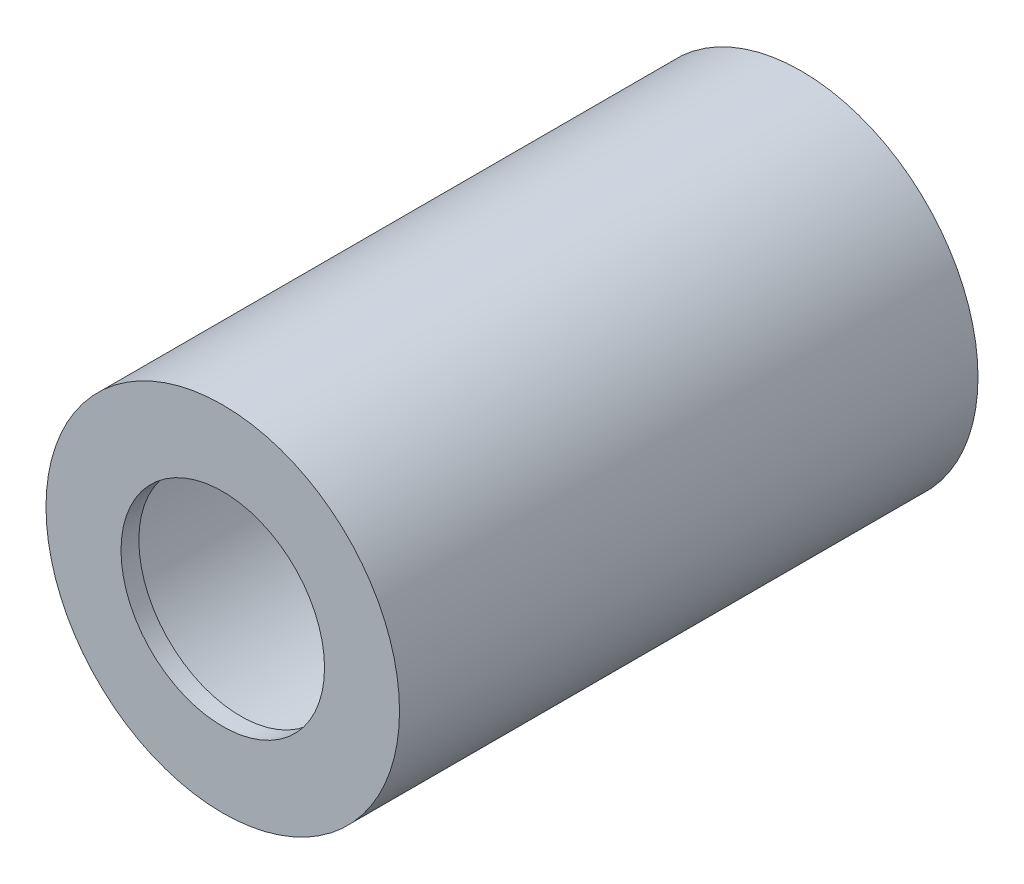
ISO-10303-21;
HEADER;
FILE_DESCRIPTION(('STEP AP214'),'2;1');
FILE_NAME('part.step','',(''),(''),'','','');
FILE_SCHEMA(('AUTOMOTIVE_DESIGN { 1 0 10303 214 1 1 1 1 }'));
ENDSEC;
DATA;
#1=APPLICATION_CONTEXT('core data for automotive mechanical design processes');
#2=APPLICATION_PROTOCOL_DEFINITION('international standard','automotive_design',2000,#1);
#3=PRODUCT_CONTEXT('',#1,'mechanical');
#4=PRODUCT('Part','Part','',(#3));
#5=PRODUCT_RELATED_PRODUCT_CATEGORY('part','',(#4));
#6=PRODUCT_DEFINITION_FORMATION('','',#4);
#7=PRODUCT_DEFINITION_CONTEXT('part definition',#1,'design');
#8=PRODUCT_DEFINITION('design','',#6,#7);
#9=PRODUCT_DEFINITION_SHAPE('','',#8);
#10=(LENGTH_UNIT() NAMED_UNIT(*) SI_UNIT(.MILLI.,.METRE.));
#11=(NAMED_UNIT(*) PLANE_ANGLE_UNIT() SI_UNIT($,.RADIAN.));
#12=(NAMED_UNIT(*) SI_UNIT($,.STERADIAN.) SOLID_ANGLE_UNIT());
#13=UNCERTAINTY_MEASURE_WITH_UNIT(LENGTH_MEASURE(1.E-05),#10,'distance_accuracy_value','');
#14=(GEOMETRIC_REPRESENTATION_CONTEXT(3) GLOBAL_UNCERTAINTY_ASSIGNED_CONTEXT((#13)) GLOBAL_UNIT_ASSIGNED_CONTEXT((#10,
#11,#12)) REPRESENTATION_CONTEXT('',''));
#15=CARTESIAN_POINT('',(0.,0.,0.));
#16=DIRECTION('',(0.,0.,1.));
#17=DIRECTION('',(1.,0.,0.));
#18=AXIS2_PLACEMENT_3D('',#15,#16,#17);
#19=CARTESIAN_POINT('',(-12.723876,-12.723876,-41.148));
#20=DIRECTION('',(0.,0.,1.));
#21=DIRECTION('',(1.,0.,0.));
#22=AXIS2_PLACEMENT_3D('',#19,#20,#21);
#23=PLANE('',#22);
#24=CARTESIAN_POINT('',(0.,0.,-41.148));
#25=DIRECTION('',(0.,0.,1.));
#26=DIRECTION('',(1.,0.,0.));
#27=AXIS2_PLACEMENT_3D('',#24,#25,#26);
#28=CIRCLE('',#27,11.049);
#29=CARTESIAN_POINT('',(11.049,0.,-41.148));
#30=VERTEX_POINT('',#29);
#31=EDGE_CURVE('E18',#30,#30,#28,.F.);
#32=ORIENTED_EDGE('',*,*,#31,.F.);
#33=EDGE_LOOP('',(#32));
#34=FACE_BOUND('',#33,.T.);
#35=CARTESIAN_POINT('',(0.,0.,-41.148));
#36=DIRECTION('',(0.,0.,1.));
#37=DIRECTION('',(1.,0.,0.));
#38=AXIS2_PLACEMENT_3D('',#35,#36,#37);
#39=CIRCLE('',#38,12.573);
#40=CARTESIAN_POINT('',(12.573,0.,-41.148));
#41=VERTEX_POINT('',#40);
#42=EDGE_CURVE('E34',#41,#41,#39,.F.);
#43=ORIENTED_EDGE('',*,*,#42,.T.);
#44=EDGE_LOOP('',(#43));
#45=FACE_BOUND('',#44,.T.);
#46=ADVANCED_FACE('F14',(#34,#45),#23,.F.);
#47=CARTESIAN_POINT('',(0.,0.,-41.148));
#48=DIRECTION('',(0.,0.,1.));
#49=DIRECTION('',(1.,0.,0.));
#50=AXIS2_PLACEMENT_3D('',#47,#48,#49);
#51=CYLINDRICAL_SURFACE('',#50,11.049);
#52=CARTESIAN_POINT('',(0.,0.,-1.27));
#53=DIRECTION('',(0.,0.,1.));
#54=DIRECTION('',(1.,0.,0.));
#55=AXIS2_PLACEMENT_3D('',#52,#53,#54);
#56=CIRCLE('',#55,11.049);
#57=CARTESIAN_POINT('',(11.049,0.,-1.27));
#58=VERTEX_POINT('',#57);
#59=EDGE_CURVE('E32',#58,#58,#56,.T.);
#60=ORIENTED_EDGE('',*,*,#59,.T.);
#61=EDGE_LOOP('',(#60));
#62=FACE_BOUND('',#61,.T.);
#63=ORIENTED_EDGE('',*,*,#31,.T.);
#64=EDGE_LOOP('',(#63));
#65=FACE_BOUND('',#64,.T.);
#66=ADVANCED_FACE('F41',(#62,#65),#51,.F.);
#67=CARTESIAN_POINT('',(0.,0.,-41.148));
#68=DIRECTION('',(0.,0.,1.));
#69=DIRECTION('',(1.,0.,0.));
#70=AXIS2_PLACEMENT_3D('',#67,#68,#69);
#71=CYLINDRICAL_SURFACE('',#70,12.573);
#72=ORIENTED_EDGE('',*,*,#42,.F.);
#73=EDGE_LOOP('',(#72));
#74=FACE_BOUND('',#73,.T.);
#75=CARTESIAN_POINT('',(0.,0.,0.));
#76=DIRECTION('',(0.,0.,1.));
#77=DIRECTION('',(1.,0.,0.));
#78=AXIS2_PLACEMENT_3D('',#75,#76,#77);
#79=CIRCLE('',#78,12.573);
#80=CARTESIAN_POINT('',(12.573,0.,0.));
#81=VERTEX_POINT('',#80);
#82=EDGE_CURVE('E27',#81,#81,#79,.T.);
#83=ORIENTED_EDGE('',*,*,#82,.F.);
#84=EDGE_LOOP('',(#83));
#85=FACE_BOUND('',#84,.T.);
#86=ADVANCED_FACE('F49',(#74,#85),#71,.T.);
#87=CARTESIAN_POINT('',(-11.181588,-11.181588,-1.27));
#88=DIRECTION('',(0.,0.,1.));
#89=DIRECTION('',(1.,0.,0.));
#90=AXIS2_PLACEMENT_3D('',#87,#88,#89);
#91=PLANE('',#90);
#92=CARTESIAN_POINT('',(0.,0.,-1.27));
#93=DIRECTION('',(0.,0.,1.));
#94=DIRECTION('',(1.,0.,0.));
#95=AXIS2_PLACEMENT_3D('',#92,#93,#94);
#96=CIRCLE('',#95,7.239);
#97=CARTESIAN_POINT('',(7.239,0.,-1.27));
#98=VERTEX_POINT('',#97);
#99=EDGE_CURVE('E22',#98,#98,#96,.F.);
#100=ORIENTED_EDGE('',*,*,#99,.F.);
#101=EDGE_LOOP('',(#100));
#102=FACE_BOUND('',#101,.T.);
#103=ORIENTED_EDGE('',*,*,#59,.F.);
#104=EDGE_LOOP('',(#103));
#105=FACE_BOUND('',#104,.T.);
#106=ADVANCED_FACE('F59',(#102,#105),#91,.F.);
#107=CARTESIAN_POINT('',(-12.723876,-12.723876,0.));
#108=DIRECTION('',(0.,0.,1.));
#109=DIRECTION('',(1.,0.,0.));
#110=AXIS2_PLACEMENT_3D('',#107,#108,#109);
#111=PLANE('',#110);
#112=CARTESIAN_POINT('',(0.,0.,0.));
#113=DIRECTION('',(0.,0.,1.));
#114=DIRECTION('',(1.,0.,0.));
#115=AXIS2_PLACEMENT_3D('',#112,#113,#114);
#116=CIRCLE('',#115,7.239);
#117=CARTESIAN_POINT('',(7.239,0.,0.));
#118=VERTEX_POINT('',#117);
#119=EDGE_CURVE('E10',#118,#118,#116,.T.);
#120=ORIENTED_EDGE('',*,*,#119,.F.);
#121=EDGE_LOOP('',(#120));
#122=FACE_BOUND('',#121,.T.);
#123=ORIENTED_EDGE('',*,*,#82,.T.);
#124=EDGE_LOOP('',(#123));
#125=FACE_BOUND('',#124,.T.);
#126=ADVANCED_FACE('F16',(#122,#125),#111,.T.);
#127=CARTESIAN_POINT('',(0.,0.,-1.27));
#128=DIRECTION('',(0.,0.,1.));
#129=DIRECTION('',(1.,0.,0.));
#130=AXIS2_PLACEMENT_3D('',#127,#128,#129);
#131=CYLINDRICAL_SURFACE('',#130,7.239);
#132=ORIENTED_EDGE('',*,*,#99,.T.);
#133=EDGE_LOOP('',(#132));
#134=FACE_BOUND('',#133,.T.);
#135=ORIENTED_EDGE('',*,*,#119,.T.);
#136=EDGE_LOOP('',(#135));
#137=FACE_BOUND('',#136,.T.);
#138=ADVANCED_FACE('F52',(#134,#137),#131,.F.);
#139=CLOSED_SHELL('',(#46,#66,#86,#106,#126,#138));
#140=MANIFOLD_SOLID_BREP('B1',#139);
#141=ADVANCED_BREP_SHAPE_REPRESENTATION('',(#18,#140),#14);
#142=SHAPE_DEFINITION_REPRESENTATION(#9,#141);
ENDSEC;
END-ISO-10303-21;
